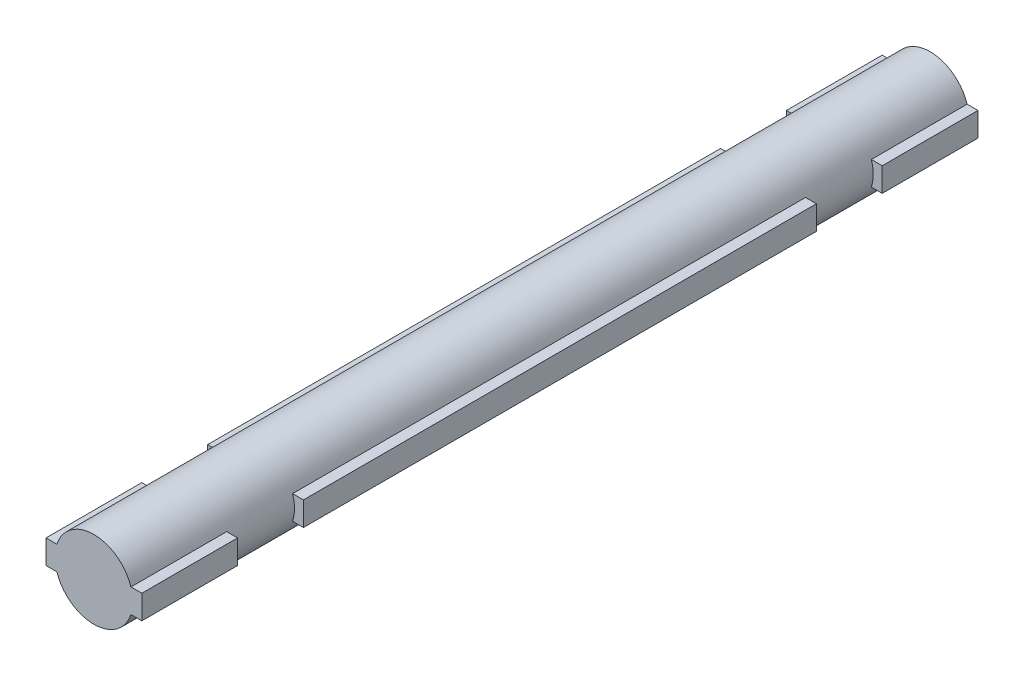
from build123d import *

# Parameters (mm, degrees)
EXTRUSION1_DEPTH        = 41.9
ENL_V_START             = -4.8
ESQUISSE2_OUTSIDE_W     = 15.27
ESQUISSE2_OUTSIDE_H     = 14.37
ESQUISSE2_OUTSIDE_R     = 1.95
ENL_V_MAT_EXTRU_1_DEPTH = 3.3


with BuildPart() as part:
    # Esquisse1 → Extrusion1 (new body)
    with BuildSketch(Plane.XY):
        with BuildLine():
            Line((2.4, 0.6), (1.855397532, 0.6))
            ThreePointArc((1.855397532, 0.6), (0, 1.95), (-1.855397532, 0.6))
            Line((-1.855397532, 0.6), (-2.4, 0.6))
            Line((-2.4, 0.6), (-2.4, -0.6))
            Line((-2.4, -0.6), (-1.855397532, -0.6))
            ThreePointArc((-1.855397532, -0.6), (0, -1.95), (1.855397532, -0.6))
            Line((1.855397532, -0.6), (2.4, -0.6))
            Line((2.4, -0.6), (2.4, 0.6))
        make_face()
    extrude(amount=EXTRUSION1_DEPTH)

    # Esquisse2 outside → Enl_v. mat.-Extru.1 (cut)
    with BuildSketch(Plane.XY.offset(41.9).offset(ENL_V_START)):
        Rectangle(ESQUISSE2_OUTSIDE_W, ESQUISSE2_OUTSIDE_H)
        with Locations(Location((0, 0, 0), (0, 0, 197.920213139))):
            Circle(ESQUISSE2_OUTSIDE_R, mode=Mode.SUBTRACT)
    enl_v_mat_extru_1 = extrude(amount=-ENL_V_MAT_EXTRU_1_DEPTH, mode=Mode.SUBTRACT)

    # Sym_trie1: Enl_v. mat.-Extru.1 across plane
    add(enl_v_mat_extru_1.mirror(Plane.XY.offset(20.95)), mode=Mode.SUBTRACT)


solid = part.part
